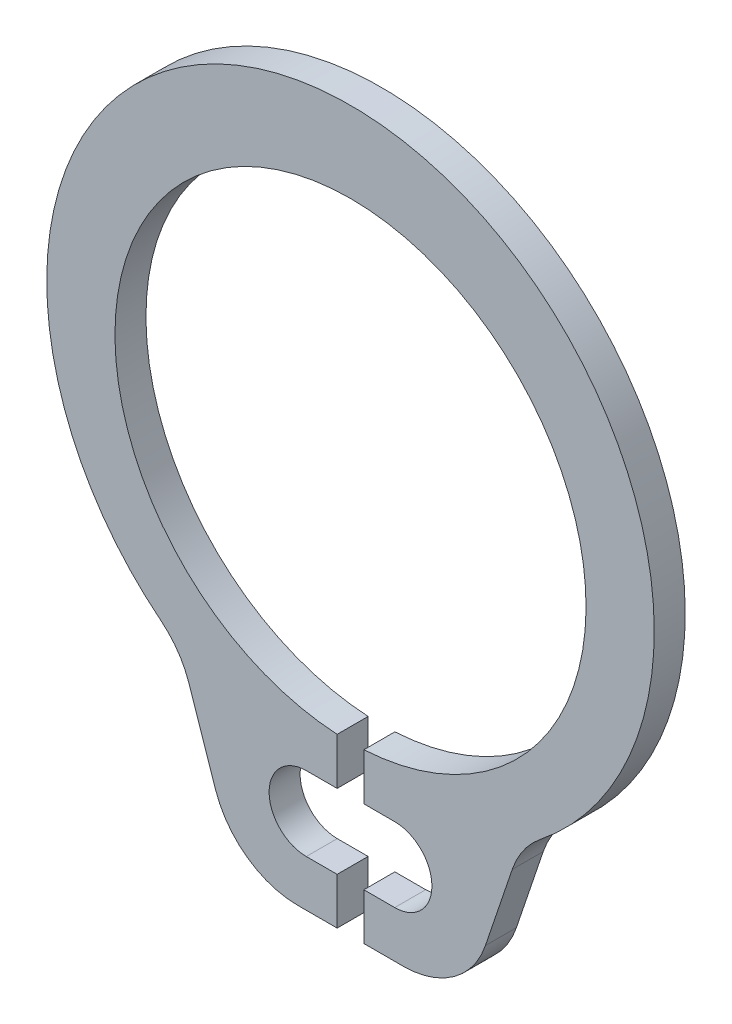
ISO-10303-21;
HEADER;
FILE_DESCRIPTION(('STEP AP214'),'2;1');
FILE_NAME('part.step','',(''),(''),'','','');
FILE_SCHEMA(('AUTOMOTIVE_DESIGN { 1 0 10303 214 1 1 1 1 }'));
ENDSEC;
DATA;
#1=APPLICATION_CONTEXT('core data for automotive mechanical design processes');
#2=APPLICATION_PROTOCOL_DEFINITION('international standard','automotive_design',2000,#1);
#3=PRODUCT_CONTEXT('',#1,'mechanical');
#4=PRODUCT('Part','Part','',(#3));
#5=PRODUCT_RELATED_PRODUCT_CATEGORY('part','',(#4));
#6=PRODUCT_DEFINITION_FORMATION('','',#4);
#7=PRODUCT_DEFINITION_CONTEXT('part definition',#1,'design');
#8=PRODUCT_DEFINITION('design','',#6,#7);
#9=PRODUCT_DEFINITION_SHAPE('','',#8);
#10=(LENGTH_UNIT() NAMED_UNIT(*) SI_UNIT(.MILLI.,.METRE.));
#11=(NAMED_UNIT(*) PLANE_ANGLE_UNIT() SI_UNIT($,.RADIAN.));
#12=(NAMED_UNIT(*) SI_UNIT($,.STERADIAN.) SOLID_ANGLE_UNIT());
#13=UNCERTAINTY_MEASURE_WITH_UNIT(LENGTH_MEASURE(1.E-05),#10,'distance_accuracy_value','');
#14=(GEOMETRIC_REPRESENTATION_CONTEXT(3) GLOBAL_UNCERTAINTY_ASSIGNED_CONTEXT((#13)) GLOBAL_UNIT_ASSIGNED_CONTEXT((#10,
#11,#12)) REPRESENTATION_CONTEXT('',''));
#15=CARTESIAN_POINT('',(0.,0.,0.));
#16=DIRECTION('',(0.,0.,1.));
#17=DIRECTION('',(1.,0.,0.));
#18=AXIS2_PLACEMENT_3D('',#15,#16,#17);
#19=CARTESIAN_POINT('',(-0.107721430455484,-1.89694388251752,0.125));
#20=DIRECTION('',(1.,0.,0.));
#21=DIRECTION('',(0.,0.,-1.));
#22=AXIS2_PLACEMENT_3D('',#19,#20,#21);
#23=PLANE('',#22);
#24=DIRECTION('',(0.,-1.,0.));
#25=VECTOR('',#24,1.);
#26=CARTESIAN_POINT('',(-0.107721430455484,-1.89694388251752,-0.125));
#27=LINE('',#26,#25);
#28=CARTESIAN_POINT('',(-0.107721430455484,-1.89694388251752,-0.125));
#29=VERTEX_POINT('',#28);
#30=CARTESIAN_POINT('',(-0.107721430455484,-2.27491299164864,-0.125));
#31=VERTEX_POINT('',#30);
#32=EDGE_CURVE('E251',#29,#31,#27,.T.);
#33=ORIENTED_EDGE('',*,*,#32,.F.);
#34=DIRECTION('',(0.,0.,-1.));
#35=VECTOR('',#34,1.);
#36=CARTESIAN_POINT('',(-0.107721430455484,-1.89694388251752,0.125));
#37=LINE('',#36,#35);
#38=CARTESIAN_POINT('',(-0.107721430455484,-1.89694388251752,0.125));
#39=VERTEX_POINT('',#38);
#40=EDGE_CURVE('E11',#39,#29,#37,.T.);
#41=ORIENTED_EDGE('',*,*,#40,.F.);
#42=DIRECTION('',(0.,-1.,0.));
#43=VECTOR('',#42,1.);
#44=CARTESIAN_POINT('',(-0.107721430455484,-1.89694388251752,0.125));
#45=LINE('',#44,#43);
#46=CARTESIAN_POINT('',(-0.107721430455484,-2.27491299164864,0.125));
#47=VERTEX_POINT('',#46);
#48=EDGE_CURVE('E179',#39,#47,#45,.T.);
#49=ORIENTED_EDGE('',*,*,#48,.T.);
#50=DIRECTION('',(0.,0.,-1.));
#51=VECTOR('',#50,1.);
#52=CARTESIAN_POINT('',(-0.107721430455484,-2.27491299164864,0.125));
#53=LINE('',#52,#51);
#54=EDGE_CURVE('E31',#47,#31,#53,.T.);
#55=ORIENTED_EDGE('',*,*,#54,.T.);
#56=EDGE_LOOP('',(#33,#41,#49,#55));
#57=FACE_BOUND('',#56,.T.);
#58=ADVANCED_FACE('F16',(#57),#23,.T.);
#59=CARTESIAN_POINT('',(0.,0.,0.125));
#60=DIRECTION('',(0.,0.,-1.));
#61=DIRECTION('',(-1.,0.,0.));
#62=AXIS2_PLACEMENT_3D('',#59,#60,#61);
#63=CYLINDRICAL_SURFACE('',#62,1.9);
#64=CARTESIAN_POINT('',(0.,0.,-0.125));
#65=DIRECTION('',(0.,0.,1.));
#66=DIRECTION('',(1.,0.,0.));
#67=AXIS2_PLACEMENT_3D('',#64,#65,#66);
#68=CIRCLE('',#67,1.9);
#69=CARTESIAN_POINT('',(0.107721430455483,-1.89694388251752,-0.125));
#70=VERTEX_POINT('',#69);
#71=EDGE_CURVE('E170',#70,#29,#68,.T.);
#72=ORIENTED_EDGE('',*,*,#71,.F.);
#73=DIRECTION('',(0.,0.,-1.));
#74=VECTOR('',#73,1.);
#75=CARTESIAN_POINT('',(0.107721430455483,-1.89694388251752,0.125));
#76=LINE('',#75,#74);
#77=CARTESIAN_POINT('',(0.107721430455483,-1.89694388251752,0.125));
#78=VERTEX_POINT('',#77);
#79=EDGE_CURVE('E19',#78,#70,#76,.T.);
#80=ORIENTED_EDGE('',*,*,#79,.F.);
#81=CARTESIAN_POINT('',(0.,0.,0.125));
#82=DIRECTION('',(0.,0.,1.));
#83=DIRECTION('',(1.,0.,0.));
#84=AXIS2_PLACEMENT_3D('',#81,#82,#83);
#85=CIRCLE('',#84,1.9);
#86=EDGE_CURVE('E254',#78,#39,#85,.T.);
#87=ORIENTED_EDGE('',*,*,#86,.T.);
#88=ORIENTED_EDGE('',*,*,#40,.T.);
#89=EDGE_LOOP('',(#72,#80,#87,#88));
#90=FACE_BOUND('',#89,.T.);
#91=ADVANCED_FACE('F176',(#90),#63,.F.);
#92=CARTESIAN_POINT('',(0.107721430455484,-1.89694388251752,0.125));
#93=DIRECTION('',(1.,0.,0.));
#94=DIRECTION('',(0.,0.,-1.));
#95=AXIS2_PLACEMENT_3D('',#92,#93,#94);
#96=PLANE('',#95);
#97=DIRECTION('',(0.,-1.,0.));
#98=VECTOR('',#97,1.);
#99=CARTESIAN_POINT('',(0.107721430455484,-1.89694388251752,-0.125));
#100=LINE('',#99,#98);
#101=CARTESIAN_POINT('',(0.107721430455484,-2.27491299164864,-0.125));
#102=VERTEX_POINT('',#101);
#103=EDGE_CURVE('E156',#70,#102,#100,.T.);
#104=ORIENTED_EDGE('',*,*,#103,.T.);
#105=DIRECTION('',(0.,0.,-1.));
#106=VECTOR('',#105,1.);
#107=CARTESIAN_POINT('',(0.107721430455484,-2.27491299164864,0.125));
#108=LINE('',#107,#106);
#109=CARTESIAN_POINT('',(0.107721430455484,-2.27491299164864,0.125));
#110=VERTEX_POINT('',#109);
#111=EDGE_CURVE('E164',#110,#102,#108,.T.);
#112=ORIENTED_EDGE('',*,*,#111,.F.);
#113=DIRECTION('',(0.,-1.,0.));
#114=VECTOR('',#113,1.);
#115=CARTESIAN_POINT('',(0.107721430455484,-1.89694388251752,0.125));
#116=LINE('',#115,#114);
#117=EDGE_CURVE('E158',#78,#110,#116,.T.);
#118=ORIENTED_EDGE('',*,*,#117,.F.);
#119=ORIENTED_EDGE('',*,*,#79,.T.);
#120=EDGE_LOOP('',(#104,#112,#118,#119));
#121=FACE_BOUND('',#120,.T.);
#122=ADVANCED_FACE('F154',(#121),#96,.F.);
#123=CARTESIAN_POINT('',(0.107721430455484,-2.27491299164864,0.125));
#124=DIRECTION('',(0.000602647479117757,0.999999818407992,0.));
#125=DIRECTION('',(-0.999999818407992,0.000602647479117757,0.));
#126=AXIS2_PLACEMENT_3D('',#123,#124,#125);
#127=PLANE('',#126);
#128=DIRECTION('',(0.999999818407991,-0.000602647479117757,0.));
#129=VECTOR('',#128,1.);
#130=CARTESIAN_POINT('',(0.107721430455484,-2.27491299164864,-0.125));
#131=LINE('',#130,#129);
#132=CARTESIAN_POINT('',(0.356633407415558,-2.27506299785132,-0.125));
#133=VERTEX_POINT('',#132);
#134=EDGE_CURVE('E173',#102,#133,#131,.T.);
#135=ORIENTED_EDGE('',*,*,#134,.T.);
#136=DIRECTION('',(0.,0.,-1.));
#137=VECTOR('',#136,1.);
#138=CARTESIAN_POINT('',(0.356633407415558,-2.27506299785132,0.125));
#139=LINE('',#138,#137);
#140=CARTESIAN_POINT('',(0.356633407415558,-2.27506299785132,0.125));
#141=VERTEX_POINT('',#140);
#142=EDGE_CURVE('E365',#141,#133,#139,.T.);
#143=ORIENTED_EDGE('',*,*,#142,.F.);
#144=DIRECTION('',(0.999999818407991,-0.000602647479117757,0.));
#145=VECTOR('',#144,1.);
#146=CARTESIAN_POINT('',(0.107721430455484,-2.27491299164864,0.125));
#147=LINE('',#146,#145);
#148=EDGE_CURVE('E259',#110,#141,#147,.T.);
#149=ORIENTED_EDGE('',*,*,#148,.F.);
#150=ORIENTED_EDGE('',*,*,#111,.T.);
#151=EDGE_LOOP('',(#135,#143,#149,#150));
#152=FACE_BOUND('',#151,.T.);
#153=ADVANCED_FACE('F372',(#152),#127,.F.);
#154=CARTESIAN_POINT('',(0.356633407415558,-2.57506299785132,0.125));
#155=DIRECTION('',(0.,0.,-1.));
#156=DIRECTION('',(-1.,0.,0.));
#157=AXIS2_PLACEMENT_3D('',#154,#155,#156);
#158=CYLINDRICAL_SURFACE('',#157,0.3);
#159=CARTESIAN_POINT('',(0.356633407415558,-2.57506299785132,-0.125));
#160=DIRECTION('',(0.,0.,1.));
#161=DIRECTION('',(1.,0.,0.));
#162=AXIS2_PLACEMENT_3D('',#159,#160,#161);
#163=CIRCLE('',#162,0.3);
#164=CARTESIAN_POINT('',(0.356633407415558,-2.87506299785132,-0.125));
#165=VERTEX_POINT('',#164);
#166=EDGE_CURVE('E191',#165,#133,#163,.T.);
#167=ORIENTED_EDGE('',*,*,#166,.F.);
#168=DIRECTION('',(0.,0.,-1.));
#169=VECTOR('',#168,1.);
#170=CARTESIAN_POINT('',(0.356633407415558,-2.87506299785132,0.125));
#171=LINE('',#170,#169);
#172=CARTESIAN_POINT('',(0.356633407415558,-2.87506299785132,0.125));
#173=VERTEX_POINT('',#172);
#174=EDGE_CURVE('E362',#173,#165,#171,.T.);
#175=ORIENTED_EDGE('',*,*,#174,.F.);
#176=CARTESIAN_POINT('',(0.356633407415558,-2.57506299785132,0.125));
#177=DIRECTION('',(0.,0.,1.));
#178=DIRECTION('',(1.,0.,0.));
#179=AXIS2_PLACEMENT_3D('',#176,#177,#178);
#180=CIRCLE('',#179,0.3);
#181=EDGE_CURVE('E262',#173,#141,#180,.T.);
#182=ORIENTED_EDGE('',*,*,#181,.T.);
#183=ORIENTED_EDGE('',*,*,#142,.T.);
#184=EDGE_LOOP('',(#167,#175,#182,#183));
#185=FACE_BOUND('',#184,.T.);
#186=ADVANCED_FACE('F438',(#185),#158,.F.);
#187=CARTESIAN_POINT('',(0.356633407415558,-2.87506299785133,0.125));
#188=DIRECTION('',(-0.000602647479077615,-0.999999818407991,0.));
#189=DIRECTION('',(0.999999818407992,-0.000602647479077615,0.));
#190=AXIS2_PLACEMENT_3D('',#187,#188,#189);
#191=PLANE('',#190);
#192=DIRECTION('',(-0.999999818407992,0.000602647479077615,0.));
#193=VECTOR('',#192,1.);
#194=CARTESIAN_POINT('',(0.356633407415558,-2.87506299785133,-0.125));
#195=LINE('',#194,#193);
#196=CARTESIAN_POINT('',(0.107721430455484,-2.87491299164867,-0.125));
#197=VERTEX_POINT('',#196);
#198=EDGE_CURVE('E194',#165,#197,#195,.T.);
#199=ORIENTED_EDGE('',*,*,#198,.T.);
#200=DIRECTION('',(0.,0.,-1.));
#201=VECTOR('',#200,1.);
#202=CARTESIAN_POINT('',(0.107721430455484,-2.87491299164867,0.125));
#203=LINE('',#202,#201);
#204=CARTESIAN_POINT('',(0.107721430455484,-2.87491299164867,0.125));
#205=VERTEX_POINT('',#204);
#206=EDGE_CURVE('E358',#205,#197,#203,.T.);
#207=ORIENTED_EDGE('',*,*,#206,.F.);
#208=DIRECTION('',(-0.999999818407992,0.000602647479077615,0.));
#209=VECTOR('',#208,1.);
#210=CARTESIAN_POINT('',(0.356633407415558,-2.87506299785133,0.125));
#211=LINE('',#210,#209);
#212=EDGE_CURVE('E266',#173,#205,#211,.T.);
#213=ORIENTED_EDGE('',*,*,#212,.F.);
#214=ORIENTED_EDGE('',*,*,#174,.T.);
#215=EDGE_LOOP('',(#199,#207,#213,#214));
#216=FACE_BOUND('',#215,.T.);
#217=ADVANCED_FACE('F440',(#216),#191,.F.);
#218=CARTESIAN_POINT('',(0.107721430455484,-2.87491299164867,0.125));
#219=DIRECTION('',(1.,0.,0.));
#220=DIRECTION('',(0.,0.,-1.));
#221=AXIS2_PLACEMENT_3D('',#218,#219,#220);
#222=PLANE('',#221);
#223=DIRECTION('',(0.,-1.,0.));
#224=VECTOR('',#223,1.);
#225=CARTESIAN_POINT('',(0.107721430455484,-2.87491299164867,-0.125));
#226=LINE('',#225,#224);
#227=CARTESIAN_POINT('',(0.107721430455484,-3.25068278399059,-0.125));
#228=VERTEX_POINT('',#227);
#229=EDGE_CURVE('E197',#197,#228,#226,.T.);
#230=ORIENTED_EDGE('',*,*,#229,.T.);
#231=DIRECTION('',(0.,0.,-1.));
#232=VECTOR('',#231,1.);
#233=CARTESIAN_POINT('',(0.107721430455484,-3.25068278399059,0.125));
#234=LINE('',#233,#232);
#235=CARTESIAN_POINT('',(0.107721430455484,-3.25068278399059,0.125));
#236=VERTEX_POINT('',#235);
#237=EDGE_CURVE('E355',#236,#228,#234,.T.);
#238=ORIENTED_EDGE('',*,*,#237,.F.);
#239=DIRECTION('',(0.,-1.,0.));
#240=VECTOR('',#239,1.);
#241=CARTESIAN_POINT('',(0.107721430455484,-2.87491299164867,0.125));
#242=LINE('',#241,#240);
#243=EDGE_CURVE('E269',#205,#236,#242,.T.);
#244=ORIENTED_EDGE('',*,*,#243,.F.);
#245=ORIENTED_EDGE('',*,*,#206,.T.);
#246=EDGE_LOOP('',(#230,#238,#244,#245));
#247=FACE_BOUND('',#246,.T.);
#248=ADVANCED_FACE('F432',(#247),#222,.F.);
#249=CARTESIAN_POINT('',(0.424935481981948,-3.25068278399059,0.125));
#250=DIRECTION('',(0.,-1.,0.));
#251=DIRECTION('',(1.,0.,0.));
#252=AXIS2_PLACEMENT_3D('',#249,#250,#251);
#253=PLANE('',#252);
#254=DIRECTION('',(-1.,0.,0.));
#255=VECTOR('',#254,1.);
#256=CARTESIAN_POINT('',(0.424935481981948,-3.25068278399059,-0.125));
#257=LINE('',#256,#255);
#258=CARTESIAN_POINT('',(0.424935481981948,-3.25068278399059,-0.125));
#259=VERTEX_POINT('',#258);
#260=EDGE_CURVE('E201',#259,#228,#257,.T.);
#261=ORIENTED_EDGE('',*,*,#260,.F.);
#262=DIRECTION('',(0.,0.,-1.));
#263=VECTOR('',#262,1.);
#264=CARTESIAN_POINT('',(0.424935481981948,-3.25068278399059,0.125));
#265=LINE('',#264,#263);
#266=CARTESIAN_POINT('',(0.424935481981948,-3.25068278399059,0.125));
#267=VERTEX_POINT('',#266);
#268=EDGE_CURVE('E352',#267,#259,#265,.T.);
#269=ORIENTED_EDGE('',*,*,#268,.F.);
#270=DIRECTION('',(-1.,0.,0.));
#271=VECTOR('',#270,1.);
#272=CARTESIAN_POINT('',(0.424935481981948,-3.25068278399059,0.125));
#273=LINE('',#272,#271);
#274=EDGE_CURVE('E272',#267,#236,#273,.T.);
#275=ORIENTED_EDGE('',*,*,#274,.T.);
#276=ORIENTED_EDGE('',*,*,#237,.T.);
#277=EDGE_LOOP('',(#261,#269,#275,#276));
#278=FACE_BOUND('',#277,.T.);
#279=ADVANCED_FACE('F426',(#278),#253,.T.);
#280=CARTESIAN_POINT('',(0.424935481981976,-2.5506827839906,0.125));
#281=DIRECTION('',(0.,0.,-1.));
#282=DIRECTION('',(-1.,0.,0.));
#283=AXIS2_PLACEMENT_3D('',#280,#281,#282);
#284=CYLINDRICAL_SURFACE('',#283,0.7);
#285=CARTESIAN_POINT('',(0.424935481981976,-2.5506827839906,-0.125));
#286=DIRECTION('',(0.,0.,1.));
#287=DIRECTION('',(1.,0.,0.));
#288=AXIS2_PLACEMENT_3D('',#285,#286,#287);
#289=CIRCLE('',#288,0.7);
#290=CARTESIAN_POINT('',(1.08806814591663,-2.77485921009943,-0.125));
#291=VERTEX_POINT('',#290);
#292=EDGE_CURVE('E205',#259,#291,#289,.T.);
#293=ORIENTED_EDGE('',*,*,#292,.T.);
#294=DIRECTION('',(0.,0.,-1.));
#295=VECTOR('',#294,1.);
#296=CARTESIAN_POINT('',(1.08806814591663,-2.77485921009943,0.125));
#297=LINE('',#296,#295);
#298=CARTESIAN_POINT('',(1.08806814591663,-2.77485921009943,0.125));
#299=VERTEX_POINT('',#298);
#300=EDGE_CURVE('E349',#299,#291,#297,.T.);
#301=ORIENTED_EDGE('',*,*,#300,.F.);
#302=CARTESIAN_POINT('',(0.424935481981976,-2.5506827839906,0.125));
#303=DIRECTION('',(0.,0.,1.));
#304=DIRECTION('',(1.,0.,0.));
#305=AXIS2_PLACEMENT_3D('',#302,#303,#304);
#306=CIRCLE('',#305,0.7);
#307=EDGE_CURVE('E276',#267,#299,#306,.T.);
#308=ORIENTED_EDGE('',*,*,#307,.F.);
#309=ORIENTED_EDGE('',*,*,#268,.T.);
#310=EDGE_LOOP('',(#293,#301,#308,#309));
#311=FACE_BOUND('',#310,.T.);
#312=ADVANCED_FACE('F441',(#311),#284,.T.);
#313=CARTESIAN_POINT('',(1.30449846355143,-2.13464018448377,0.125));
#314=DIRECTION('',(0.947332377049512,-0.320252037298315,0.));
#315=DIRECTION('',(0.320252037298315,0.947332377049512,0.));
#316=AXIS2_PLACEMENT_3D('',#313,#314,#315);
#317=PLANE('',#316);
#318=DIRECTION('',(-0.320252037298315,-0.947332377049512,0.));
#319=VECTOR('',#318,1.);
#320=CARTESIAN_POINT('',(1.30449846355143,-2.13464018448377,-0.125));
#321=LINE('',#320,#319);
#322=CARTESIAN_POINT('',(1.30449846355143,-2.13464018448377,-0.125));
#323=VERTEX_POINT('',#322);
#324=EDGE_CURVE('E209',#323,#291,#321,.T.);
#325=ORIENTED_EDGE('',*,*,#324,.F.);
#326=DIRECTION('',(0.,0.,-1.));
#327=VECTOR('',#326,1.);
#328=CARTESIAN_POINT('',(1.30449846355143,-2.13464018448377,0.125));
#329=LINE('',#328,#327);
#330=CARTESIAN_POINT('',(1.30449846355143,-2.13464018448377,0.125));
#331=VERTEX_POINT('',#330);
#332=EDGE_CURVE('E346',#331,#323,#329,.T.);
#333=ORIENTED_EDGE('',*,*,#332,.F.);
#334=DIRECTION('',(-0.320252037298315,-0.947332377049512,0.));
#335=VECTOR('',#334,1.);
#336=CARTESIAN_POINT('',(1.30449846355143,-2.13464018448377,0.125));
#337=LINE('',#336,#335);
#338=EDGE_CURVE('E279',#331,#299,#337,.T.);
#339=ORIENTED_EDGE('',*,*,#338,.T.);
#340=ORIENTED_EDGE('',*,*,#300,.T.);
#341=EDGE_LOOP('',(#325,#333,#339,#340));
#342=FACE_BOUND('',#341,.T.);
#343=ADVANCED_FACE('F419',(#342),#317,.T.);
#344=CARTESIAN_POINT('',(1.96763112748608,-2.35881661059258,0.125));
#345=DIRECTION('',(0.,0.,-1.));
#346=DIRECTION('',(-1.,0.,0.));
#347=AXIS2_PLACEMENT_3D('',#344,#345,#346);
#348=CYLINDRICAL_SURFACE('',#347,0.7);
#349=CARTESIAN_POINT('',(1.96763112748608,-2.35881661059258,-0.125));
#350=DIRECTION('',(0.,0.,1.));
#351=DIRECTION('',(1.,0.,0.));
#352=AXIS2_PLACEMENT_3D('',#349,#350,#351);
#353=CIRCLE('',#352,0.7);
#354=CARTESIAN_POINT('',(1.53037976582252,-1.81218030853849,-0.125));
#355=VERTEX_POINT('',#354);
#356=EDGE_CURVE('E213',#355,#323,#353,.T.);
#357=ORIENTED_EDGE('',*,*,#356,.F.);
#358=DIRECTION('',(0.,0.,-1.));
#359=VECTOR('',#358,1.);
#360=CARTESIAN_POINT('',(1.53037976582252,-1.81218030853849,0.125));
#361=LINE('',#360,#359);
#362=CARTESIAN_POINT('',(1.53037976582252,-1.81218030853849,0.125));
#363=VERTEX_POINT('',#362);
#364=EDGE_CURVE('E343',#363,#355,#361,.T.);
#365=ORIENTED_EDGE('',*,*,#364,.F.);
#366=CARTESIAN_POINT('',(1.96763112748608,-2.35881661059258,0.125));
#367=DIRECTION('',(0.,0.,1.));
#368=DIRECTION('',(1.,0.,0.));
#369=AXIS2_PLACEMENT_3D('',#366,#367,#368);
#370=CIRCLE('',#369,0.7);
#371=EDGE_CURVE('E283',#363,#331,#370,.T.);
#372=ORIENTED_EDGE('',*,*,#371,.T.);
#373=ORIENTED_EDGE('',*,*,#332,.T.);
#374=EDGE_LOOP('',(#357,#365,#372,#373));
#375=FACE_BOUND('',#374,.T.);
#376=ADVANCED_FACE('F414',(#375),#348,.F.);
#377=CARTESIAN_POINT('',(0.,0.101046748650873,0.125));
#378=DIRECTION('',(0.,0.,-1.));
#379=DIRECTION('',(-1.,0.,0.));
#380=AXIS2_PLACEMENT_3D('',#377,#378,#379);
#381=CYLINDRICAL_SURFACE('',#380,2.45);
#382=CARTESIAN_POINT('',(0.,0.101046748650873,-0.125));
#383=DIRECTION('',(0.,0.,1.));
#384=DIRECTION('',(1.,0.,0.));
#385=AXIS2_PLACEMENT_3D('',#382,#383,#384);
#386=CIRCLE('',#385,2.45);
#387=CARTESIAN_POINT('',(-1.53037976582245,-1.81218030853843,-0.125));
#388=VERTEX_POINT('',#387);
#389=EDGE_CURVE('E217',#355,#388,#386,.T.);
#390=ORIENTED_EDGE('',*,*,#389,.T.);
#391=DIRECTION('',(0.,0.,-1.));
#392=VECTOR('',#391,1.);
#393=CARTESIAN_POINT('',(-1.53037976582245,-1.81218030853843,0.125));
#394=LINE('',#393,#392);
#395=CARTESIAN_POINT('',(-1.53037976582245,-1.81218030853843,0.125));
#396=VERTEX_POINT('',#395);
#397=EDGE_CURVE('E340',#396,#388,#394,.T.);
#398=ORIENTED_EDGE('',*,*,#397,.F.);
#399=CARTESIAN_POINT('',(0.,0.101046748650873,0.125));
#400=DIRECTION('',(0.,0.,1.));
#401=DIRECTION('',(1.,0.,0.));
#402=AXIS2_PLACEMENT_3D('',#399,#400,#401);
#403=CIRCLE('',#402,2.45);
#404=EDGE_CURVE('E287',#363,#396,#403,.T.);
#405=ORIENTED_EDGE('',*,*,#404,.F.);
#406=ORIENTED_EDGE('',*,*,#364,.T.);
#407=EDGE_LOOP('',(#390,#398,#405,#406));
#408=FACE_BOUND('',#407,.T.);
#409=ADVANCED_FACE('F411',(#408),#381,.T.);
#410=CARTESIAN_POINT('',(-1.96763112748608,-2.35881661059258,0.125));
#411=DIRECTION('',(0.,0.,-1.));
#412=DIRECTION('',(-1.,0.,0.));
#413=AXIS2_PLACEMENT_3D('',#410,#411,#412);
#414=CYLINDRICAL_SURFACE('',#413,0.7);
#415=CARTESIAN_POINT('',(-1.96763112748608,-2.35881661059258,-0.125));
#416=DIRECTION('',(0.,0.,1.));
#417=DIRECTION('',(1.,0.,0.));
#418=AXIS2_PLACEMENT_3D('',#415,#416,#417);
#419=CIRCLE('',#418,0.7);
#420=CARTESIAN_POINT('',(-1.30449846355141,-2.13464018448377,-0.125));
#421=VERTEX_POINT('',#420);
#422=EDGE_CURVE('E221',#421,#388,#419,.T.);
#423=ORIENTED_EDGE('',*,*,#422,.F.);
#424=DIRECTION('',(0.,0.,-1.));
#425=VECTOR('',#424,1.);
#426=CARTESIAN_POINT('',(-1.30449846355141,-2.13464018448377,0.125));
#427=LINE('',#426,#425);
#428=CARTESIAN_POINT('',(-1.30449846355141,-2.13464018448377,0.125));
#429=VERTEX_POINT('',#428);
#430=EDGE_CURVE('E337',#429,#421,#427,.T.);
#431=ORIENTED_EDGE('',*,*,#430,.F.);
#432=CARTESIAN_POINT('',(-1.96763112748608,-2.35881661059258,0.125));
#433=DIRECTION('',(0.,0.,1.));
#434=DIRECTION('',(1.,0.,0.));
#435=AXIS2_PLACEMENT_3D('',#432,#433,#434);
#436=CIRCLE('',#435,0.7);
#437=EDGE_CURVE('E290',#429,#396,#436,.T.);
#438=ORIENTED_EDGE('',*,*,#437,.T.);
#439=ORIENTED_EDGE('',*,*,#397,.T.);
#440=EDGE_LOOP('',(#423,#431,#438,#439));
#441=FACE_BOUND('',#440,.T.);
#442=ADVANCED_FACE('F405',(#441),#414,.F.);
#443=CARTESIAN_POINT('',(-1.30449846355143,-2.13464018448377,0.125));
#444=DIRECTION('',(0.947332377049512,0.320252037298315,0.));
#445=DIRECTION('',(-0.320252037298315,0.947332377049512,0.));
#446=AXIS2_PLACEMENT_3D('',#443,#444,#445);
#447=PLANE('',#446);
#448=DIRECTION('',(0.320252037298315,-0.947332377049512,0.));
#449=VECTOR('',#448,1.);
#450=CARTESIAN_POINT('',(-1.30449846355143,-2.13464018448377,-0.125));
#451=LINE('',#450,#449);
#452=CARTESIAN_POINT('',(-1.08806814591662,-2.77485921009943,-0.125));
#453=VERTEX_POINT('',#452);
#454=EDGE_CURVE('E225',#421,#453,#451,.T.);
#455=ORIENTED_EDGE('',*,*,#454,.T.);
#456=DIRECTION('',(0.,0.,-1.));
#457=VECTOR('',#456,1.);
#458=CARTESIAN_POINT('',(-1.08806814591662,-2.77485921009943,0.125));
#459=LINE('',#458,#457);
#460=CARTESIAN_POINT('',(-1.08806814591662,-2.77485921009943,0.125));
#461=VERTEX_POINT('',#460);
#462=EDGE_CURVE('E333',#461,#453,#459,.T.);
#463=ORIENTED_EDGE('',*,*,#462,.F.);
#464=DIRECTION('',(0.320252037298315,-0.947332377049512,0.));
#465=VECTOR('',#464,1.);
#466=CARTESIAN_POINT('',(-1.30449846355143,-2.13464018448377,0.125));
#467=LINE('',#466,#465);
#468=EDGE_CURVE('E294',#429,#461,#467,.T.);
#469=ORIENTED_EDGE('',*,*,#468,.F.);
#470=ORIENTED_EDGE('',*,*,#430,.T.);
#471=EDGE_LOOP('',(#455,#463,#469,#470));
#472=FACE_BOUND('',#471,.T.);
#473=ADVANCED_FACE('F523',(#472),#447,.F.);
#474=CARTESIAN_POINT('',(-0.424935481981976,-2.5506827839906,0.125));
#475=DIRECTION('',(0.,0.,-1.));
#476=DIRECTION('',(-1.,0.,0.));
#477=AXIS2_PLACEMENT_3D('',#474,#475,#476);
#478=CYLINDRICAL_SURFACE('',#477,0.7);
#479=CARTESIAN_POINT('',(-0.424935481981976,-2.5506827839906,-0.125));
#480=DIRECTION('',(0.,0.,1.));
#481=DIRECTION('',(1.,0.,0.));
#482=AXIS2_PLACEMENT_3D('',#479,#480,#481);
#483=CIRCLE('',#482,0.7);
#484=CARTESIAN_POINT('',(-0.424935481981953,-3.25068278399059,-0.125));
#485=VERTEX_POINT('',#484);
#486=EDGE_CURVE('E228',#453,#485,#483,.T.);
#487=ORIENTED_EDGE('',*,*,#486,.T.);
#488=DIRECTION('',(0.,0.,-1.));
#489=VECTOR('',#488,1.);
#490=CARTESIAN_POINT('',(-0.424935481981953,-3.25068278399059,0.125));
#491=LINE('',#490,#489);
#492=CARTESIAN_POINT('',(-0.424935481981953,-3.25068278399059,0.125));
#493=VERTEX_POINT('',#492);
#494=EDGE_CURVE('E329',#493,#485,#491,.T.);
#495=ORIENTED_EDGE('',*,*,#494,.F.);
#496=CARTESIAN_POINT('',(-0.424935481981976,-2.5506827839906,0.125));
#497=DIRECTION('',(0.,0.,1.));
#498=DIRECTION('',(1.,0.,0.));
#499=AXIS2_PLACEMENT_3D('',#496,#497,#498);
#500=CIRCLE('',#499,0.7);
#501=EDGE_CURVE('E297',#461,#493,#500,.T.);
#502=ORIENTED_EDGE('',*,*,#501,.F.);
#503=ORIENTED_EDGE('',*,*,#462,.T.);
#504=EDGE_LOOP('',(#487,#495,#502,#503));
#505=FACE_BOUND('',#504,.T.);
#506=ADVANCED_FACE('F398',(#505),#478,.T.);
#507=CARTESIAN_POINT('',(-0.424935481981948,-3.25068278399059,0.125));
#508=DIRECTION('',(0.,1.,0.));
#509=DIRECTION('',(0.,0.,1.));
#510=AXIS2_PLACEMENT_3D('',#507,#508,#509);
#511=PLANE('',#510);
#512=DIRECTION('',(1.,0.,0.));
#513=VECTOR('',#512,1.);
#514=CARTESIAN_POINT('',(-0.424935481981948,-3.25068278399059,-0.125));
#515=LINE('',#514,#513);
#516=CARTESIAN_POINT('',(-0.107721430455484,-3.25068278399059,-0.125));
#517=VERTEX_POINT('',#516);
#518=EDGE_CURVE('E231',#485,#517,#515,.T.);
#519=ORIENTED_EDGE('',*,*,#518,.T.);
#520=DIRECTION('',(0.,0.,-1.));
#521=VECTOR('',#520,1.);
#522=CARTESIAN_POINT('',(-0.107721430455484,-3.25068278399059,0.125));
#523=LINE('',#522,#521);
#524=CARTESIAN_POINT('',(-0.107721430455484,-3.25068278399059,0.125));
#525=VERTEX_POINT('',#524);
#526=EDGE_CURVE('E326',#525,#517,#523,.T.);
#527=ORIENTED_EDGE('',*,*,#526,.F.);
#528=DIRECTION('',(1.,0.,0.));
#529=VECTOR('',#528,1.);
#530=CARTESIAN_POINT('',(-0.424935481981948,-3.25068278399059,0.125));
#531=LINE('',#530,#529);
#532=EDGE_CURVE('E300',#493,#525,#531,.T.);
#533=ORIENTED_EDGE('',*,*,#532,.F.);
#534=ORIENTED_EDGE('',*,*,#494,.T.);
#535=EDGE_LOOP('',(#519,#527,#533,#534));
#536=FACE_BOUND('',#535,.T.);
#537=ADVANCED_FACE('F394',(#536),#511,.F.);
#538=CARTESIAN_POINT('',(-0.107721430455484,-2.87491299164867,0.125));
#539=DIRECTION('',(1.,0.,0.));
#540=DIRECTION('',(0.,1.,0.));
#541=AXIS2_PLACEMENT_3D('',#538,#539,#540);
#542=PLANE('',#541);
#543=DIRECTION('',(0.,-1.,0.));
#544=VECTOR('',#543,1.);
#545=CARTESIAN_POINT('',(-0.107721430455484,-2.87491299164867,-0.125));
#546=LINE('',#545,#544);
#547=CARTESIAN_POINT('',(-0.107721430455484,-2.87491299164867,-0.125));
#548=VERTEX_POINT('',#547);
#549=EDGE_CURVE('E235',#548,#517,#546,.T.);
#550=ORIENTED_EDGE('',*,*,#549,.F.);
#551=DIRECTION('',(0.,0.,-1.));
#552=VECTOR('',#551,1.);
#553=CARTESIAN_POINT('',(-0.107721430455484,-2.87491299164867,0.125));
#554=LINE('',#553,#552);
#555=CARTESIAN_POINT('',(-0.107721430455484,-2.87491299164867,0.125));
#556=VERTEX_POINT('',#555);
#557=EDGE_CURVE('E323',#556,#548,#554,.T.);
#558=ORIENTED_EDGE('',*,*,#557,.F.);
#559=DIRECTION('',(0.,-1.,0.));
#560=VECTOR('',#559,1.);
#561=CARTESIAN_POINT('',(-0.107721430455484,-2.87491299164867,0.125));
#562=LINE('',#561,#560);
#563=EDGE_CURVE('E303',#556,#525,#562,.T.);
#564=ORIENTED_EDGE('',*,*,#563,.T.);
#565=ORIENTED_EDGE('',*,*,#526,.T.);
#566=EDGE_LOOP('',(#550,#558,#564,#565));
#567=FACE_BOUND('',#566,.T.);
#568=ADVANCED_FACE('F389',(#567),#542,.T.);
#569=CARTESIAN_POINT('',(-0.356633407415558,-2.87506299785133,0.125));
#570=DIRECTION('',(-0.000602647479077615,0.999999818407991,0.));
#571=DIRECTION('',(-0.999999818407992,-0.000602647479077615,0.));
#572=AXIS2_PLACEMENT_3D('',#569,#570,#571);
#573=PLANE('',#572);
#574=DIRECTION('',(0.999999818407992,0.000602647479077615,0.));
#575=VECTOR('',#574,1.);
#576=CARTESIAN_POINT('',(-0.356633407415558,-2.87506299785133,-0.125));
#577=LINE('',#576,#575);
#578=CARTESIAN_POINT('',(-0.356633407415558,-2.87506299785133,-0.125));
#579=VERTEX_POINT('',#578);
#580=EDGE_CURVE('E239',#579,#548,#577,.T.);
#581=ORIENTED_EDGE('',*,*,#580,.F.);
#582=DIRECTION('',(0.,0.,-1.));
#583=VECTOR('',#582,1.);
#584=CARTESIAN_POINT('',(-0.356633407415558,-2.87506299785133,0.125));
#585=LINE('',#584,#583);
#586=CARTESIAN_POINT('',(-0.356633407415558,-2.87506299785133,0.125));
#587=VERTEX_POINT('',#586);
#588=EDGE_CURVE('E320',#587,#579,#585,.T.);
#589=ORIENTED_EDGE('',*,*,#588,.F.);
#590=DIRECTION('',(0.999999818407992,0.000602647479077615,0.));
#591=VECTOR('',#590,1.);
#592=CARTESIAN_POINT('',(-0.356633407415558,-2.87506299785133,0.125));
#593=LINE('',#592,#591);
#594=EDGE_CURVE('E307',#587,#556,#593,.T.);
#595=ORIENTED_EDGE('',*,*,#594,.T.);
#596=ORIENTED_EDGE('',*,*,#557,.T.);
#597=EDGE_LOOP('',(#581,#589,#595,#596));
#598=FACE_BOUND('',#597,.T.);
#599=ADVANCED_FACE('F384',(#598),#573,.T.);
#600=CARTESIAN_POINT('',(-0.356633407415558,-2.57506299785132,0.125));
#601=DIRECTION('',(0.,0.,-1.));
#602=DIRECTION('',(-1.,0.,0.));
#603=AXIS2_PLACEMENT_3D('',#600,#601,#602);
#604=CYLINDRICAL_SURFACE('',#603,0.3);
#605=CARTESIAN_POINT('',(-0.356633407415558,-2.57506299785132,-0.125));
#606=DIRECTION('',(0.,0.,1.));
#607=DIRECTION('',(1.,0.,0.));
#608=AXIS2_PLACEMENT_3D('',#605,#606,#607);
#609=CIRCLE('',#608,0.3);
#610=CARTESIAN_POINT('',(-0.356633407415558,-2.27506299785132,-0.125));
#611=VERTEX_POINT('',#610);
#612=EDGE_CURVE('E243',#611,#579,#609,.T.);
#613=ORIENTED_EDGE('',*,*,#612,.F.);
#614=DIRECTION('',(0.,0.,-1.));
#615=VECTOR('',#614,1.);
#616=CARTESIAN_POINT('',(-0.356633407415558,-2.27506299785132,0.125));
#617=LINE('',#616,#615);
#618=CARTESIAN_POINT('',(-0.356633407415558,-2.27506299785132,0.125));
#619=VERTEX_POINT('',#618);
#620=EDGE_CURVE('E39',#619,#611,#617,.T.);
#621=ORIENTED_EDGE('',*,*,#620,.F.);
#622=CARTESIAN_POINT('',(-0.356633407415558,-2.57506299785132,0.125));
#623=DIRECTION('',(0.,0.,1.));
#624=DIRECTION('',(1.,0.,0.));
#625=AXIS2_PLACEMENT_3D('',#622,#623,#624);
#626=CIRCLE('',#625,0.3);
#627=EDGE_CURVE('E311',#619,#587,#626,.T.);
#628=ORIENTED_EDGE('',*,*,#627,.T.);
#629=ORIENTED_EDGE('',*,*,#588,.T.);
#630=EDGE_LOOP('',(#613,#621,#628,#629));
#631=FACE_BOUND('',#630,.T.);
#632=ADVANCED_FACE('F380',(#631),#604,.F.);
#633=CARTESIAN_POINT('',(-0.107721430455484,-2.27491299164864,0.125));
#634=DIRECTION('',(0.000602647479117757,-0.999999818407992,0.));
#635=DIRECTION('',(0.999999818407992,0.000602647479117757,0.));
#636=AXIS2_PLACEMENT_3D('',#633,#634,#635);
#637=PLANE('',#636);
#638=DIRECTION('',(-0.999999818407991,-0.000602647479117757,0.));
#639=VECTOR('',#638,1.);
#640=CARTESIAN_POINT('',(-0.107721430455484,-2.27491299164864,-0.125));
#641=LINE('',#640,#639);
#642=EDGE_CURVE('E247',#31,#611,#641,.T.);
#643=ORIENTED_EDGE('',*,*,#642,.F.);
#644=ORIENTED_EDGE('',*,*,#54,.F.);
#645=DIRECTION('',(-0.999999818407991,-0.000602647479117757,0.));
#646=VECTOR('',#645,1.);
#647=CARTESIAN_POINT('',(-0.107721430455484,-2.27491299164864,0.125));
#648=LINE('',#647,#646);
#649=EDGE_CURVE('E186',#47,#619,#648,.T.);
#650=ORIENTED_EDGE('',*,*,#649,.T.);
#651=ORIENTED_EDGE('',*,*,#620,.T.);
#652=EDGE_LOOP('',(#643,#644,#650,#651));
#653=FACE_BOUND('',#652,.T.);
#654=ADVANCED_FACE('F379',(#653),#637,.T.);
#655=CARTESIAN_POINT('',(-0.356633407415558,-2.57506299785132,0.125));
#656=DIRECTION('',(0.,0.,1.));
#657=DIRECTION('',(1.,0.,0.));
#658=AXIS2_PLACEMENT_3D('',#655,#656,#657);
#659=PLANE('',#658);
#660=ORIENTED_EDGE('',*,*,#48,.F.);
#661=ORIENTED_EDGE('',*,*,#86,.F.);
#662=ORIENTED_EDGE('',*,*,#117,.T.);
#663=ORIENTED_EDGE('',*,*,#148,.T.);
#664=ORIENTED_EDGE('',*,*,#181,.F.);
#665=ORIENTED_EDGE('',*,*,#212,.T.);
#666=ORIENTED_EDGE('',*,*,#243,.T.);
#667=ORIENTED_EDGE('',*,*,#274,.F.);
#668=ORIENTED_EDGE('',*,*,#307,.T.);
#669=ORIENTED_EDGE('',*,*,#338,.F.);
#670=ORIENTED_EDGE('',*,*,#371,.F.);
#671=ORIENTED_EDGE('',*,*,#404,.T.);
#672=ORIENTED_EDGE('',*,*,#437,.F.);
#673=ORIENTED_EDGE('',*,*,#468,.T.);
#674=ORIENTED_EDGE('',*,*,#501,.T.);
#675=ORIENTED_EDGE('',*,*,#532,.T.);
#676=ORIENTED_EDGE('',*,*,#563,.F.);
#677=ORIENTED_EDGE('',*,*,#594,.F.);
#678=ORIENTED_EDGE('',*,*,#627,.F.);
#679=ORIENTED_EDGE('',*,*,#649,.F.);
#680=EDGE_LOOP('',(#660,#661,#662,#663,#664,#665,#666,#667,#668,#669,#670,#671,#672,#673,#674,
#675,#676,#677,#678,#679));
#681=FACE_BOUND('',#680,.T.);
#682=ADVANCED_FACE('F377',(#681),#659,.T.);
#683=CARTESIAN_POINT('',(-0.356633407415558,-2.57506299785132,-0.125));
#684=DIRECTION('',(0.,0.,1.));
#685=DIRECTION('',(1.,0.,0.));
#686=AXIS2_PLACEMENT_3D('',#683,#684,#685);
#687=PLANE('',#686);
#688=ORIENTED_EDGE('',*,*,#32,.T.);
#689=ORIENTED_EDGE('',*,*,#642,.T.);
#690=ORIENTED_EDGE('',*,*,#612,.T.);
#691=ORIENTED_EDGE('',*,*,#580,.T.);
#692=ORIENTED_EDGE('',*,*,#549,.T.);
#693=ORIENTED_EDGE('',*,*,#518,.F.);
#694=ORIENTED_EDGE('',*,*,#486,.F.);
#695=ORIENTED_EDGE('',*,*,#454,.F.);
#696=ORIENTED_EDGE('',*,*,#422,.T.);
#697=ORIENTED_EDGE('',*,*,#389,.F.);
#698=ORIENTED_EDGE('',*,*,#356,.T.);
#699=ORIENTED_EDGE('',*,*,#324,.T.);
#700=ORIENTED_EDGE('',*,*,#292,.F.);
#701=ORIENTED_EDGE('',*,*,#260,.T.);
#702=ORIENTED_EDGE('',*,*,#229,.F.);
#703=ORIENTED_EDGE('',*,*,#198,.F.);
#704=ORIENTED_EDGE('',*,*,#166,.T.);
#705=ORIENTED_EDGE('',*,*,#134,.F.);
#706=ORIENTED_EDGE('',*,*,#103,.F.);
#707=ORIENTED_EDGE('',*,*,#71,.T.);
#708=EDGE_LOOP('',(#688,#689,#690,#691,#692,#693,#694,#695,#696,#697,#698,#699,#700,#701,#702,
#703,#704,#705,#706,#707));
#709=FACE_BOUND('',#708,.T.);
#710=ADVANCED_FACE('F169',(#709),#687,.F.);
#711=CLOSED_SHELL('',(#58,#91,#122,#153,#186,#217,#248,#279,#312,#343,#376,#409,#442,#473,#506,
#537,#568,#599,#632,#654,#682,#710));
#712=MANIFOLD_SOLID_BREP('B1',#711);
#713=ADVANCED_BREP_SHAPE_REPRESENTATION('',(#18,#712),#14);
#714=SHAPE_DEFINITION_REPRESENTATION(#9,#713);
ENDSEC;
END-ISO-10303-21;
